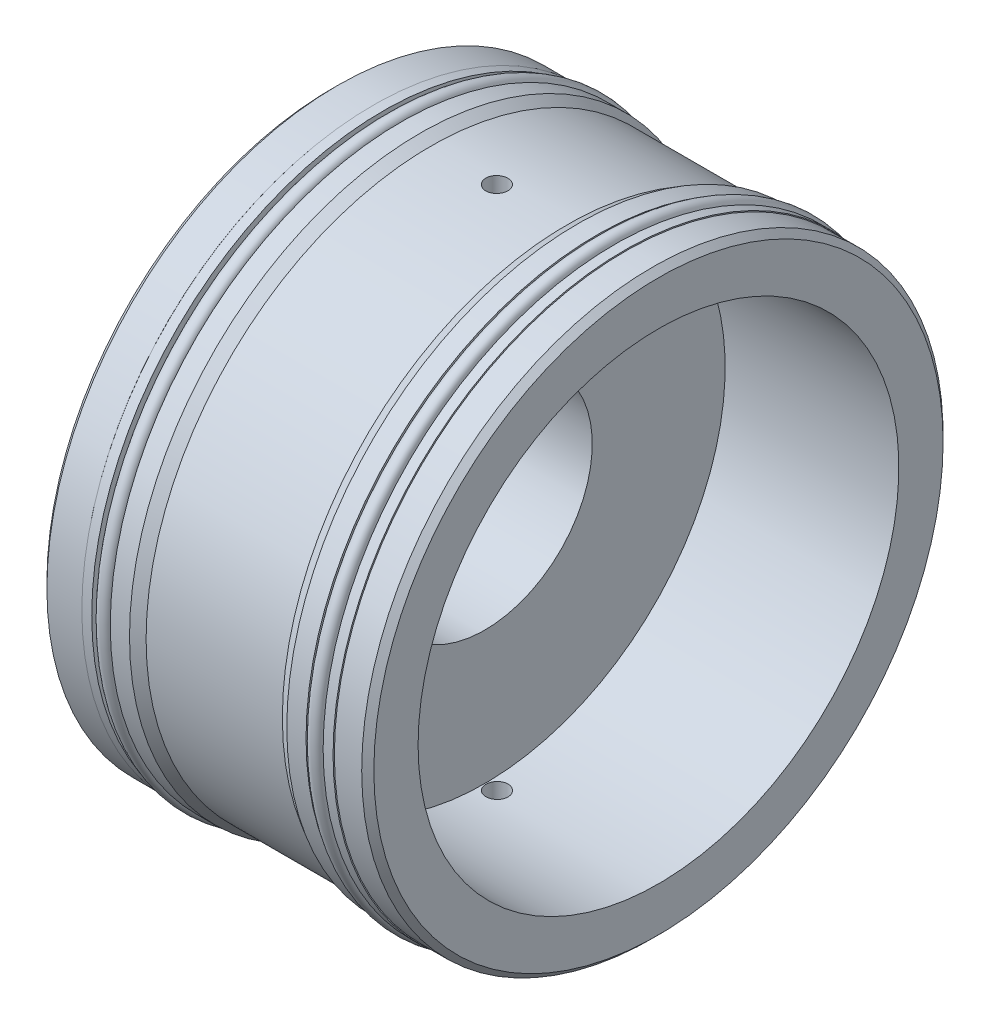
ISO-10303-21;
HEADER;
FILE_DESCRIPTION(('STEP AP214'),'2;1');
FILE_NAME('part.step','',(''),(''),'','','');
FILE_SCHEMA(('AUTOMOTIVE_DESIGN { 1 0 10303 214 1 1 1 1 }'));
ENDSEC;
DATA;
#1=APPLICATION_CONTEXT('core data for automotive mechanical design processes');
#2=APPLICATION_PROTOCOL_DEFINITION('international standard','automotive_design',2000,#1);
#3=PRODUCT_CONTEXT('',#1,'mechanical');
#4=PRODUCT('Part','Part','',(#3));
#5=PRODUCT_RELATED_PRODUCT_CATEGORY('part','',(#4));
#6=PRODUCT_DEFINITION_FORMATION('','',#4);
#7=PRODUCT_DEFINITION_CONTEXT('part definition',#1,'design');
#8=PRODUCT_DEFINITION('design','',#6,#7);
#9=PRODUCT_DEFINITION_SHAPE('','',#8);
#10=(LENGTH_UNIT() NAMED_UNIT(*) SI_UNIT(.MILLI.,.METRE.));
#11=(NAMED_UNIT(*) PLANE_ANGLE_UNIT() SI_UNIT($,.RADIAN.));
#12=(NAMED_UNIT(*) SI_UNIT($,.STERADIAN.) SOLID_ANGLE_UNIT());
#13=UNCERTAINTY_MEASURE_WITH_UNIT(LENGTH_MEASURE(1.E-05),#10,'distance_accuracy_value','');
#14=(GEOMETRIC_REPRESENTATION_CONTEXT(3) GLOBAL_UNCERTAINTY_ASSIGNED_CONTEXT((#13)) GLOBAL_UNIT_ASSIGNED_CONTEXT((#10,
#11,#12)) REPRESENTATION_CONTEXT('',''));
#15=CARTESIAN_POINT('',(0.,0.,0.));
#16=DIRECTION('',(0.,0.,1.));
#17=DIRECTION('',(1.,0.,0.));
#18=AXIS2_PLACEMENT_3D('',#15,#16,#17);
#19=CARTESIAN_POINT('',(0.,0.,0.));
#20=DIRECTION('',(-1.,0.,0.));
#21=DIRECTION('',(0.,0.,1.));
#22=AXIS2_PLACEMENT_3D('',#19,#20,#21);
#23=CYLINDRICAL_SURFACE('',#22,35.7124);
#24=CARTESIAN_POINT('',(-8.0654772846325,0.,0.));
#25=DIRECTION('',(-1.,0.,0.));
#26=DIRECTION('',(0.,0.,1.));
#27=AXIS2_PLACEMENT_3D('',#24,#25,#26);
#28=CIRCLE('',#27,35.7124);
#29=CARTESIAN_POINT('',(-8.0654772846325,0.,35.7124));
#30=VERTEX_POINT('',#29);
#31=EDGE_CURVE('E37',#30,#30,#28,.T.);
#32=ORIENTED_EDGE('',*,*,#31,.F.);
#33=EDGE_LOOP('',(#32));
#34=FACE_BOUND('',#33,.T.);
#35=CARTESIAN_POINT('',(0.2413,-35.6855604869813,1.3843));
#36=CARTESIAN_POINT('',(0.319025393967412,-35.6855608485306,1.38429656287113));
#37=CARTESIAN_POINT('',(0.396806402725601,-35.6858171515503,1.3777318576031));
#38=CARTESIAN_POINT('',(0.550224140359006,-35.686814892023,1.35163624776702));
#39=CARTESIAN_POINT('',(0.625858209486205,-35.687556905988,1.3320899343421));
#40=CARTESIAN_POINT('',(0.77273736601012,-35.6894418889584,1.28059031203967));
#41=CARTESIAN_POINT('',(0.843984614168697,-35.6905846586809,1.24864316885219));
#42=CARTESIAN_POINT('',(0.980085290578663,-35.6931421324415,1.17325783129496));
#43=CARTESIAN_POINT('',(1.04494025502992,-35.6945567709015,1.12982240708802));
#44=CARTESIAN_POINT('',(1.16647824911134,-35.6974996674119,1.0326605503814));
#45=CARTESIAN_POINT('',(1.22315656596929,-35.6990279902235,0.978928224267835));
#46=CARTESIAN_POINT('',(1.32669242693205,-35.7020254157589,0.862708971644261));
#47=CARTESIAN_POINT('',(1.37354957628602,-35.7034945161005,0.800221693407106));
#48=CARTESIAN_POINT('',(1.45612355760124,-35.7062083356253,0.668244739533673));
#49=CARTESIAN_POINT('',(1.49183708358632,-35.7074529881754,0.598752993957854));
#50=CARTESIAN_POINT('',(1.55108871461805,-35.7095770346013,0.45475437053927));
#51=CARTESIAN_POINT('',(1.57462688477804,-35.7104564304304,0.380247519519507));
#52=CARTESIAN_POINT('',(1.60884819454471,-35.7117504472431,0.228373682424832));
#53=CARTESIAN_POINT('',(1.61953784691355,-35.7121653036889,0.151008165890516));
#54=CARTESIAN_POINT('',(1.62777876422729,-35.71248427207,-0.00442023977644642));
#55=CARTESIAN_POINT('',(1.62533010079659,-35.7123883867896,-0.0824831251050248));
#56=CARTESIAN_POINT('',(1.60736934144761,-35.711696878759,-0.237046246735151));
#57=CARTESIAN_POINT('',(1.59186426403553,-35.7111015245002,-0.31354729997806));
#58=CARTESIAN_POINT('',(1.54824167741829,-35.7094784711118,-0.462859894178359));
#59=CARTESIAN_POINT('',(1.52012413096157,-35.7084507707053,-0.535671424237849));
#60=CARTESIAN_POINT('',(1.45206672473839,-35.7060783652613,-0.675560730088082));
#61=CARTESIAN_POINT('',(1.41212365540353,-35.7047335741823,-0.742636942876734));
#62=CARTESIAN_POINT('',(1.3215514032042,-35.701878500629,-0.869134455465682));
#63=CARTESIAN_POINT('',(1.27092217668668,-35.7003682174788,-0.928555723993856));
#64=CARTESIAN_POINT('',(1.16037508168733,-35.6973511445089,-1.03809751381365));
#65=CARTESIAN_POINT('',(1.10045112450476,-35.6958443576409,-1.08821189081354));
#66=CARTESIAN_POINT('',(0.97303702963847,-35.6930051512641,-1.17767002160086));
#67=CARTESIAN_POINT('',(0.905546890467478,-35.6916727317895,-1.2170137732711));
#68=CARTESIAN_POINT('',(0.764912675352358,-35.6893325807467,-1.28381321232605));
#69=CARTESIAN_POINT('',(0.691768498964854,-35.6883248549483,-1.31126868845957));
#70=CARTESIAN_POINT('',(0.541904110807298,-35.686747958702,-1.35350820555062));
#71=CARTESIAN_POINT('',(0.46518391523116,-35.6861787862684,-1.3682923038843));
#72=CARTESIAN_POINT('',(0.310398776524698,-35.6855435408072,-1.38476183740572));
#73=CARTESIAN_POINT('',(0.232334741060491,-35.6854771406,-1.38645579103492));
#74=CARTESIAN_POINT('',(0.0770308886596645,-35.6858540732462,-1.37671916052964));
#75=CARTESIAN_POINT('',(-0.000208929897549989,-35.6862974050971,-1.3652886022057));
#76=CARTESIAN_POINT('',(-0.151647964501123,-35.6876435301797,-1.32963447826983));
#77=CARTESIAN_POINT('',(-0.225848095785,-35.6885461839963,-1.30541479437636));
#78=CARTESIAN_POINT('',(-0.369129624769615,-35.6907090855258,-1.24487385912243));
#79=CARTESIAN_POINT('',(-0.43821100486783,-35.6919693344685,-1.20855256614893));
#80=CARTESIAN_POINT('',(-0.569333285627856,-35.6947061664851,-1.12481751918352));
#81=CARTESIAN_POINT('',(-0.631370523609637,-35.6961828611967,-1.07739803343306));
#82=CARTESIAN_POINT('',(-0.746606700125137,-35.699185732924,-0.972821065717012));
#83=CARTESIAN_POINT('',(-0.799805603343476,-35.7007119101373,-0.915663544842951));
#84=CARTESIAN_POINT('',(-0.895883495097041,-35.7036426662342,-0.793196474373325));
#85=CARTESIAN_POINT('',(-0.938756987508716,-35.7050471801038,-0.727882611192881));
#86=CARTESIAN_POINT('',(-1.01292947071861,-35.7075753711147,-0.590978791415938));
#87=CARTESIAN_POINT('',(-1.04422849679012,-35.7086990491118,-0.519388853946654));
#88=CARTESIAN_POINT('',(-1.09435394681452,-35.710538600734,-0.371985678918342));
#89=CARTESIAN_POINT('',(-1.11318391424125,-35.7112545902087,-0.296173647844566));
#90=CARTESIAN_POINT('',(-1.13784834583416,-35.712198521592,-0.142461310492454));
#91=CARTESIAN_POINT('',(-1.143682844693,-35.7124264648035,-0.064561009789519));
#92=CARTESIAN_POINT('',(-1.14219032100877,-35.7123686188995,0.0910618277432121));
#93=CARTESIAN_POINT('',(-1.13487193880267,-35.7120831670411,0.168784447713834));
#94=CARTESIAN_POINT('',(-1.10729920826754,-35.7110313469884,0.321896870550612));
#95=CARTESIAN_POINT('',(-1.08704483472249,-35.7102649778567,0.39728666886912));
#96=CARTESIAN_POINT('',(-1.03417659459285,-35.7083376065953,0.543595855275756));
#97=CARTESIAN_POINT('',(-1.00156255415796,-35.7071765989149,0.614515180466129));
#98=CARTESIAN_POINT('',(-0.924902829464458,-35.7045906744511,0.749871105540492));
#99=CARTESIAN_POINT('',(-0.8808575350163,-35.7031657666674,0.81430792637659));
#100=CARTESIAN_POINT('',(-0.782556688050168,-35.7002115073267,0.934911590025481));
#101=CARTESIAN_POINT('',(-0.728295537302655,-35.698682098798,0.99107386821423));
#102=CARTESIAN_POINT('',(-0.611098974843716,-35.6956914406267,1.09350809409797));
#103=CARTESIAN_POINT('',(-0.548161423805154,-35.6942302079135,1.13977759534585));
#104=CARTESIAN_POINT('',(-0.415364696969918,-35.6915400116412,1.22112587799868));
#105=CARTESIAN_POINT('',(-0.345500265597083,-35.6903112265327,1.25619607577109));
#106=CARTESIAN_POINT('',(-0.200923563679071,-35.6882275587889,1.31406771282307));
#107=CARTESIAN_POINT('',(-0.126217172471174,-35.6873722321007,1.33688373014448));
#108=CARTESIAN_POINT('',(-0.00231812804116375,-35.686359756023,1.36357609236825));
#109=CARTESIAN_POINT('',(0.0460709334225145,-35.6860613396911,1.37133772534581));
#110=CARTESIAN_POINT('',(0.143399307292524,-35.6856615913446,1.38170076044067));
#111=CARTESIAN_POINT('',(0.192338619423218,-35.6855602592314,1.38430216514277));
#112=CARTESIAN_POINT('',(0.2413,-35.6855604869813,1.3843));
#113=B_SPLINE_CURVE_WITH_KNOTS('',3,(#35,#36,#37,#38,#39,#40,#41,#42,#43,#44,#45,#46,#47,#48,
#49,#50,#51,#52,#53,#54,#55,#56,#57,#58,#59,#60,#61,#62,#63,#64,#65,#66,#67,#68,#69,#70,#71,#72,
#73,#74,#75,#76,#77,#78,#79,#80,#81,#82,#83,#84,#85,#86,#87,#88,#89,#90,#91,#92,#93,#94,#95,#96,
#97,#98,#99,#100,#101,#102,#103,#104,#105,#106,#107,#108,#109,#110,#111,#112),.UNSPECIFIED.,.T.,
.F.,(4,2,2,2,2,2,2,2,2,2,2,2,2,2,2,2,2,2,2,2,2,2,2,2,2,2,2,2,2,2,2,2,2,2,2,2,2,2,4),(0.,
0.232997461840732,0.466271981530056,0.699430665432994,0.932533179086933,1.16576951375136,
1.39901522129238,1.6323300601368,1.86564365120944,2.0988389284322,2.33203293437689,
2.5651016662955,2.79817108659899,3.03130382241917,3.26443751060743,3.4977245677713,
3.73101167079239,3.96430291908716,4.19759311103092,4.4307314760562,4.6638693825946,
4.89693656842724,5.13000455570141,5.363193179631,5.59638273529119,5.8296961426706,
6.06300883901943,6.29625520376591,6.52950094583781,6.76259352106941,6.99568655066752,
7.22878285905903,7.46187121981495,7.69508768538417,7.92836175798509,8.16181419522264,
8.39498828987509,8.54175992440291,8.68853148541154),.UNSPECIFIED.);
#114=CARTESIAN_POINT('',(0.2413,-35.6855604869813,1.3843));
#115=VERTEX_POINT('',#114);
#116=EDGE_CURVE('E48',#115,#115,#113,.T.);
#117=ORIENTED_EDGE('',*,*,#116,.T.);
#118=EDGE_LOOP('',(#117));
#119=FACE_BOUND('',#118,.T.);
#120=CARTESIAN_POINT('',(0.2413,35.6855604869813,1.3843));
#121=CARTESIAN_POINT('',(0.163574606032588,35.6855608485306,1.38429656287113));
#122=CARTESIAN_POINT('',(0.085793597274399,35.6858171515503,1.3777318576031));
#123=CARTESIAN_POINT('',(-0.0676241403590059,35.686814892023,1.35163624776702));
#124=CARTESIAN_POINT('',(-0.143258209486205,35.687556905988,1.3320899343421));
#125=CARTESIAN_POINT('',(-0.29013736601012,35.6894418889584,1.28059031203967));
#126=CARTESIAN_POINT('',(-0.361384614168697,35.6905846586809,1.24864316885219));
#127=CARTESIAN_POINT('',(-0.497485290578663,35.6931421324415,1.17325783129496));
#128=CARTESIAN_POINT('',(-0.562340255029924,35.6945567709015,1.12982240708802));
#129=CARTESIAN_POINT('',(-0.683878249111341,35.6974996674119,1.0326605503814));
#130=CARTESIAN_POINT('',(-0.74055656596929,35.6990279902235,0.978928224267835));
#131=CARTESIAN_POINT('',(-0.844092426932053,35.7020254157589,0.862708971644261));
#132=CARTESIAN_POINT('',(-0.890949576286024,35.7034945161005,0.800221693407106));
#133=CARTESIAN_POINT('',(-0.973523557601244,35.7062083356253,0.668244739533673));
#134=CARTESIAN_POINT('',(-1.00923708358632,35.7074529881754,0.598752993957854));
#135=CARTESIAN_POINT('',(-1.06848871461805,35.7095770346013,0.454754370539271));
#136=CARTESIAN_POINT('',(-1.09202688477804,35.7104564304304,0.380247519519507));
#137=CARTESIAN_POINT('',(-1.12624819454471,35.7117504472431,0.228373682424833));
#138=CARTESIAN_POINT('',(-1.13693784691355,35.7121653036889,0.151008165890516));
#139=CARTESIAN_POINT('',(-1.14517876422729,35.71248427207,-0.00442023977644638));
#140=CARTESIAN_POINT('',(-1.14273010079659,35.7123883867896,-0.0824831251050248));
#141=CARTESIAN_POINT('',(-1.12476934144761,35.711696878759,-0.237046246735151));
#142=CARTESIAN_POINT('',(-1.10926426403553,35.7111015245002,-0.31354729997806));
#143=CARTESIAN_POINT('',(-1.06564167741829,35.7094784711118,-0.462859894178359));
#144=CARTESIAN_POINT('',(-1.03752413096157,35.7084507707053,-0.535671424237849));
#145=CARTESIAN_POINT('',(-0.969466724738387,35.7060783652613,-0.675560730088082));
#146=CARTESIAN_POINT('',(-0.929523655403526,35.7047335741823,-0.742636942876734));
#147=CARTESIAN_POINT('',(-0.838951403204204,35.701878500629,-0.869134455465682));
#148=CARTESIAN_POINT('',(-0.788322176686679,35.7003682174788,-0.928555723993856));
#149=CARTESIAN_POINT('',(-0.677775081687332,35.6973511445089,-1.03809751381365));
#150=CARTESIAN_POINT('',(-0.617851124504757,35.6958443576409,-1.08821189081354));
#151=CARTESIAN_POINT('',(-0.490437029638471,35.6930051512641,-1.17767002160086));
#152=CARTESIAN_POINT('',(-0.422946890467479,35.6916727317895,-1.2170137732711));
#153=CARTESIAN_POINT('',(-0.282312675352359,35.6893325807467,-1.28381321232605));
#154=CARTESIAN_POINT('',(-0.209168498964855,35.6883248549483,-1.31126868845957));
#155=CARTESIAN_POINT('',(-0.0593041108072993,35.686747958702,-1.35350820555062));
#156=CARTESIAN_POINT('',(0.0174160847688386,35.6861787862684,-1.3682923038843));
#157=CARTESIAN_POINT('',(0.172201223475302,35.6855435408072,-1.38476183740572));
#158=CARTESIAN_POINT('',(0.250265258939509,35.6854771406,-1.38645579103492));
#159=CARTESIAN_POINT('',(0.405569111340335,35.6858540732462,-1.37671916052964));
#160=CARTESIAN_POINT('',(0.482808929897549,35.6862974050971,-1.3652886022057));
#161=CARTESIAN_POINT('',(0.634247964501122,35.6876435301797,-1.32963447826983));
#162=CARTESIAN_POINT('',(0.708448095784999,35.6885461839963,-1.30541479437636));
#163=CARTESIAN_POINT('',(0.851729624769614,35.6907090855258,-1.24487385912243));
#164=CARTESIAN_POINT('',(0.920811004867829,35.6919693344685,-1.20855256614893));
#165=CARTESIAN_POINT('',(1.05193328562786,35.6947061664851,-1.12481751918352));
#166=CARTESIAN_POINT('',(1.11397052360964,35.6961828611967,-1.07739803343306));
#167=CARTESIAN_POINT('',(1.22920670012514,35.699185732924,-0.972821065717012));
#168=CARTESIAN_POINT('',(1.28240560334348,35.7007119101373,-0.915663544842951));
#169=CARTESIAN_POINT('',(1.37848349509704,35.7036426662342,-0.793196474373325));
#170=CARTESIAN_POINT('',(1.42135698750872,35.7050471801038,-0.727882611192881));
#171=CARTESIAN_POINT('',(1.49552947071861,35.7075753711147,-0.590978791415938));
#172=CARTESIAN_POINT('',(1.52682849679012,35.7086990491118,-0.519388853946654));
#173=CARTESIAN_POINT('',(1.57695394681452,35.710538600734,-0.371985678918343));
#174=CARTESIAN_POINT('',(1.59578391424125,35.7112545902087,-0.296173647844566));
#175=CARTESIAN_POINT('',(1.62044834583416,35.712198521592,-0.142461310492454));
#176=CARTESIAN_POINT('',(1.626282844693,35.7124264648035,-0.0645610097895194));
#177=CARTESIAN_POINT('',(1.62479032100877,35.7123686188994,0.0910618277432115));
#178=CARTESIAN_POINT('',(1.61747193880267,35.7120831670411,0.168784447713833));
#179=CARTESIAN_POINT('',(1.58989920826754,35.7110313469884,0.321896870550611));
#180=CARTESIAN_POINT('',(1.56964483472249,35.7102649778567,0.397286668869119));
#181=CARTESIAN_POINT('',(1.51677659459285,35.7083376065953,0.543595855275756));
#182=CARTESIAN_POINT('',(1.48416255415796,35.7071765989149,0.614515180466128));
#183=CARTESIAN_POINT('',(1.40750282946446,35.7045906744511,0.749871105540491));
#184=CARTESIAN_POINT('',(1.3634575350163,35.7031657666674,0.814307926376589));
#185=CARTESIAN_POINT('',(1.26515668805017,35.7002115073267,0.934911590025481));
#186=CARTESIAN_POINT('',(1.21089553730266,35.698682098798,0.991073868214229));
#187=CARTESIAN_POINT('',(1.09369897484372,35.6956914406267,1.09350809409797));
#188=CARTESIAN_POINT('',(1.03076142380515,35.6942302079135,1.13977759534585));
#189=CARTESIAN_POINT('',(0.897964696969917,35.6915400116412,1.22112587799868));
#190=CARTESIAN_POINT('',(0.828100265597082,35.6903112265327,1.25619607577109));
#191=CARTESIAN_POINT('',(0.68352356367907,35.6882275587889,1.31406771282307));
#192=CARTESIAN_POINT('',(0.608817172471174,35.6873722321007,1.33688373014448));
#193=CARTESIAN_POINT('',(0.484918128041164,35.686359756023,1.36357609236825));
#194=CARTESIAN_POINT('',(0.436529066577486,35.6860613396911,1.37133772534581));
#195=CARTESIAN_POINT('',(0.339200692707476,35.6856615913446,1.38170076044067));
#196=CARTESIAN_POINT('',(0.290261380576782,35.6855602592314,1.38430216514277));
#197=CARTESIAN_POINT('',(0.2413,35.6855604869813,1.3843));
#198=B_SPLINE_CURVE_WITH_KNOTS('',3,(#120,#121,#122,#123,#124,#125,#126,#127,#128,#129,#130,
#131,#132,#133,#134,#135,#136,#137,#138,#139,#140,#141,#142,#143,#144,#145,#146,#147,#148,#149,
#150,#151,#152,#153,#154,#155,#156,#157,#158,#159,#160,#161,#162,#163,#164,#165,#166,#167,#168,
#169,#170,#171,#172,#173,#174,#175,#176,#177,#178,#179,#180,#181,#182,#183,#184,#185,#186,#187,
#188,#189,#190,#191,#192,#193,#194,#195,#196,#197),.UNSPECIFIED.,.T.,.F.,(4,2,2,2,2,2,2,2,2,2,2,
2,2,2,2,2,2,2,2,2,2,2,2,2,2,2,2,2,2,2,2,2,2,2,2,2,2,2,4),(0.,0.232997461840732,
0.466271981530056,0.699430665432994,0.932533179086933,1.16576951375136,1.39901522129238,
1.6323300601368,1.86564365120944,2.0988389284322,2.33203293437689,2.5651016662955,
2.79817108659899,3.03130382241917,3.26443751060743,3.4977245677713,3.73101167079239,
3.96430291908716,4.19759311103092,4.4307314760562,4.6638693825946,4.89693656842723,
5.13000455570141,5.363193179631,5.59638273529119,5.8296961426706,6.06300883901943,
6.29625520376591,6.52950094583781,6.76259352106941,6.99568655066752,7.22878285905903,
7.46187121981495,7.69508768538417,7.92836175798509,8.16181419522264,8.39498828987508,
8.5417599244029,8.68853148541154),.UNSPECIFIED.);
#199=CARTESIAN_POINT('',(0.2413,35.6855604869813,1.3843));
#200=VERTEX_POINT('',#199);
#201=EDGE_CURVE('E56',#200,#200,#198,.T.);
#202=ORIENTED_EDGE('',*,*,#201,.T.);
#203=EDGE_LOOP('',(#202));
#204=FACE_BOUND('',#203,.T.);
#205=CARTESIAN_POINT('',(9.03067728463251,0.,0.));
#206=DIRECTION('',(1.,0.,0.));
#207=DIRECTION('',(0.,0.,-1.));
#208=AXIS2_PLACEMENT_3D('',#205,#206,#207);
#209=CIRCLE('',#208,35.7124);
#210=CARTESIAN_POINT('',(9.03067728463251,0.,-35.7124));
#211=VERTEX_POINT('',#210);
#212=EDGE_CURVE('E10',#211,#211,#209,.T.);
#213=ORIENTED_EDGE('',*,*,#212,.F.);
#214=EDGE_LOOP('',(#213));
#215=FACE_BOUND('',#214,.T.);
#216=ADVANCED_FACE('F30',(#34,#119,#204,#215),#23,.T.);
#217=CARTESIAN_POINT('',(0.,0.,0.));
#218=DIRECTION('',(-1.,0.,0.));
#219=DIRECTION('',(0.,0.,1.));
#220=AXIS2_PLACEMENT_3D('',#217,#218,#219);
#221=CYLINDRICAL_SURFACE('',#220,35.2171);
#222=CARTESIAN_POINT('',(14.0888071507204,0.,0.));
#223=DIRECTION('',(-1.,0.,0.));
#224=DIRECTION('',(0.,0.,1.));
#225=AXIS2_PLACEMENT_3D('',#222,#223,#224);
#226=CIRCLE('',#225,35.2171);
#227=CARTESIAN_POINT('',(14.0888071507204,0.,35.2171));
#228=VERTEX_POINT('',#227);
#229=EDGE_CURVE('E206',#228,#228,#226,.T.);
#230=ORIENTED_EDGE('',*,*,#229,.F.);
#231=EDGE_LOOP('',(#230));
#232=FACE_BOUND('',#231,.T.);
#233=CARTESIAN_POINT('',(14.9987,0.,0.));
#234=DIRECTION('',(1.,0.,0.));
#235=DIRECTION('',(0.,0.,-1.));
#236=AXIS2_PLACEMENT_3D('',#233,#234,#235);
#237=CIRCLE('',#236,35.2171);
#238=CARTESIAN_POINT('',(14.9987,0.,-35.2171));
#239=VERTEX_POINT('',#238);
#240=EDGE_CURVE('E41',#239,#239,#237,.T.);
#241=ORIENTED_EDGE('',*,*,#240,.F.);
#242=EDGE_LOOP('',(#241));
#243=FACE_BOUND('',#242,.T.);
#244=ADVANCED_FACE('F121',(#232,#243),#221,.T.);
#245=CARTESIAN_POINT('',(16.3195,0.,0.));
#246=DIRECTION('',(-1.,0.,0.));
#247=DIRECTION('',(0.,0.,1.));
#248=AXIS2_PLACEMENT_3D('',#245,#246,#247);
#249=CIRCLE('',#248,35.2171);
#250=CARTESIAN_POINT('',(16.3195,0.,35.2171));
#251=VERTEX_POINT('',#250);
#252=EDGE_CURVE('E167',#251,#251,#249,.T.);
#253=ORIENTED_EDGE('',*,*,#252,.T.);
#254=EDGE_LOOP('',(#253));
#255=FACE_BOUND('',#254,.T.);
#256=CARTESIAN_POINT('',(16.2433,0.,0.));
#257=DIRECTION('',(-1.,0.,0.));
#258=DIRECTION('',(0.,0.,1.));
#259=AXIS2_PLACEMENT_3D('',#256,#257,#258);
#260=CIRCLE('',#259,35.2171);
#261=CARTESIAN_POINT('',(16.2433,0.,35.2171));
#262=VERTEX_POINT('',#261);
#263=EDGE_CURVE('E45',#262,#262,#260,.T.);
#264=ORIENTED_EDGE('',*,*,#263,.F.);
#265=EDGE_LOOP('',(#264));
#266=FACE_BOUND('',#265,.T.);
#267=ADVANCED_FACE('F126',(#255,#266),#221,.T.);
#268=CARTESIAN_POINT('',(12.7635,0.,0.));
#269=DIRECTION('',(-1.,0.,0.));
#270=DIRECTION('',(0.,0.,1.));
#271=AXIS2_PLACEMENT_3D('',#268,#269,#270);
#272=CIRCLE('',#271,35.2171);
#273=CARTESIAN_POINT('',(12.7635,0.,35.2171));
#274=VERTEX_POINT('',#273);
#275=EDGE_CURVE('E158',#274,#274,#272,.T.);
#276=ORIENTED_EDGE('',*,*,#275,.F.);
#277=EDGE_LOOP('',(#276));
#278=FACE_BOUND('',#277,.T.);
#279=CARTESIAN_POINT('',(13.3685928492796,0.,0.));
#280=DIRECTION('',(1.,0.,0.));
#281=DIRECTION('',(0.,0.,-1.));
#282=AXIS2_PLACEMENT_3D('',#279,#280,#281);
#283=CIRCLE('',#282,35.2171);
#284=CARTESIAN_POINT('',(13.3685928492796,0.,-35.2171));
#285=VERTEX_POINT('',#284);
#286=EDGE_CURVE('E209',#285,#285,#283,.T.);
#287=ORIENTED_EDGE('',*,*,#286,.F.);
#288=EDGE_LOOP('',(#287));
#289=FACE_BOUND('',#288,.T.);
#290=ADVANCED_FACE('F129',(#278,#289),#221,.T.);
#291=CARTESIAN_POINT('',(0.,0.,0.));
#292=DIRECTION('',(-1.,0.,0.));
#293=DIRECTION('',(0.,0.,1.));
#294=AXIS2_PLACEMENT_3D('',#291,#292,#293);
#295=CYLINDRICAL_SURFACE('',#294,35.2171);
#296=CARTESIAN_POINT('',(-14.0335,0.,0.));
#297=DIRECTION('',(-1.,0.,0.));
#298=DIRECTION('',(0.,0.,1.));
#299=AXIS2_PLACEMENT_3D('',#296,#297,#298);
#300=CIRCLE('',#299,35.2171);
#301=CARTESIAN_POINT('',(-14.0335,0.,35.2171));
#302=VERTEX_POINT('',#301);
#303=EDGE_CURVE('E194',#302,#302,#300,.T.);
#304=ORIENTED_EDGE('',*,*,#303,.F.);
#305=EDGE_LOOP('',(#304));
#306=FACE_BOUND('',#305,.T.);
#307=CARTESIAN_POINT('',(-13.1236071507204,0.,0.));
#308=DIRECTION('',(1.,0.,0.));
#309=DIRECTION('',(0.,0.,-1.));
#310=AXIS2_PLACEMENT_3D('',#307,#308,#309);
#311=CIRCLE('',#310,35.2171);
#312=CARTESIAN_POINT('',(-13.1236071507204,0.,-35.2171));
#313=VERTEX_POINT('',#312);
#314=EDGE_CURVE('E203',#313,#313,#311,.T.);
#315=ORIENTED_EDGE('',*,*,#314,.F.);
#316=EDGE_LOOP('',(#315));
#317=FACE_BOUND('',#316,.T.);
#318=ADVANCED_FACE('F221',(#306,#317),#295,.T.);
#319=CARTESIAN_POINT('',(-11.7983,0.,0.));
#320=DIRECTION('',(-1.,0.,0.));
#321=DIRECTION('',(0.,0.,1.));
#322=AXIS2_PLACEMENT_3D('',#319,#320,#321);
#323=CIRCLE('',#322,35.2171);
#324=CARTESIAN_POINT('',(-11.7983,0.,35.2171));
#325=VERTEX_POINT('',#324);
#326=EDGE_CURVE('E161',#325,#325,#323,.T.);
#327=ORIENTED_EDGE('',*,*,#326,.T.);
#328=EDGE_LOOP('',(#327));
#329=FACE_BOUND('',#328,.T.);
#330=CARTESIAN_POINT('',(-12.4033928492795,0.,0.));
#331=DIRECTION('',(-1.,0.,0.));
#332=DIRECTION('',(0.,0.,1.));
#333=AXIS2_PLACEMENT_3D('',#330,#331,#332);
#334=CIRCLE('',#333,35.2171);
#335=CARTESIAN_POINT('',(-12.4033928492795,0.,35.2171));
#336=VERTEX_POINT('',#335);
#337=EDGE_CURVE('E200',#336,#336,#334,.T.);
#338=ORIENTED_EDGE('',*,*,#337,.F.);
#339=EDGE_LOOP('',(#338));
#340=FACE_BOUND('',#339,.T.);
#341=ADVANCED_FACE('F269',(#329,#340),#295,.T.);
#342=CARTESIAN_POINT('',(-15.3543,0.,0.));
#343=DIRECTION('',(-1.,0.,0.));
#344=DIRECTION('',(0.,0.,1.));
#345=AXIS2_PLACEMENT_3D('',#342,#343,#344);
#346=CIRCLE('',#345,35.2171);
#347=CARTESIAN_POINT('',(-15.3543,0.,35.2171));
#348=VERTEX_POINT('',#347);
#349=EDGE_CURVE('E258',#348,#348,#346,.T.);
#350=ORIENTED_EDGE('',*,*,#349,.F.);
#351=EDGE_LOOP('',(#350));
#352=FACE_BOUND('',#351,.T.);
#353=CARTESIAN_POINT('',(-15.2781,0.,0.));
#354=DIRECTION('',(1.,0.,0.));
#355=DIRECTION('',(0.,0.,-1.));
#356=AXIS2_PLACEMENT_3D('',#353,#354,#355);
#357=CIRCLE('',#356,35.2171);
#358=CARTESIAN_POINT('',(-15.2781,0.,-35.2171));
#359=VERTEX_POINT('',#358);
#360=EDGE_CURVE('E197',#359,#359,#357,.T.);
#361=ORIENTED_EDGE('',*,*,#360,.F.);
#362=EDGE_LOOP('',(#361));
#363=FACE_BOUND('',#362,.T.);
#364=ADVANCED_FACE('F103',(#352,#363),#295,.T.);
#365=CARTESIAN_POINT('',(0.,0.,0.));
#366=DIRECTION('',(-1.,0.,0.));
#367=DIRECTION('',(0.,0.,1.));
#368=AXIS2_PLACEMENT_3D('',#365,#366,#367);
#369=CYLINDRICAL_SURFACE('',#368,13.4874);
#370=CARTESIAN_POINT('',(-1.2827,0.,0.));
#371=DIRECTION('',(-1.,0.,0.));
#372=DIRECTION('',(0.,0.,1.));
#373=AXIS2_PLACEMENT_3D('',#370,#371,#372);
#374=CIRCLE('',#373,13.4874);
#375=CARTESIAN_POINT('',(-1.2827,0.,13.4874));
#376=VERTEX_POINT('',#375);
#377=EDGE_CURVE('E179',#376,#376,#374,.T.);
#378=ORIENTED_EDGE('',*,*,#377,.F.);
#379=EDGE_LOOP('',(#378));
#380=FACE_BOUND('',#379,.T.);
#381=CARTESIAN_POINT('',(-20.5105,0.,0.));
#382=DIRECTION('',(-1.,0.,0.));
#383=DIRECTION('',(0.,0.,1.));
#384=AXIS2_PLACEMENT_3D('',#381,#382,#383);
#385=CIRCLE('',#384,13.4874);
#386=CARTESIAN_POINT('',(-20.5105,0.,13.4874));
#387=VERTEX_POINT('',#386);
#388=EDGE_CURVE('E252',#387,#387,#385,.T.);
#389=ORIENTED_EDGE('',*,*,#388,.T.);
#390=EDGE_LOOP('',(#389));
#391=FACE_BOUND('',#390,.T.);
#392=ADVANCED_FACE('F100',(#380,#391),#369,.F.);
#393=CARTESIAN_POINT('',(-1.2827,13.4874,0.));
#394=DIRECTION('',(-1.,0.,0.));
#395=DIRECTION('',(0.,0.,1.));
#396=AXIS2_PLACEMENT_3D('',#393,#394,#395);
#397=PLANE('',#396);
#398=CARTESIAN_POINT('',(-1.2827,0.,0.));
#399=DIRECTION('',(-1.,0.,0.));
#400=DIRECTION('',(0.,0.,1.));
#401=AXIS2_PLACEMENT_3D('',#398,#399,#400);
#402=CIRCLE('',#401,30.1625);
#403=CARTESIAN_POINT('',(-1.2827,0.,30.1625));
#404=VERTEX_POINT('',#403);
#405=EDGE_CURVE('E176',#404,#404,#402,.T.);
#406=ORIENTED_EDGE('',*,*,#405,.F.);
#407=EDGE_LOOP('',(#406));
#408=FACE_BOUND('',#407,.T.);
#409=ORIENTED_EDGE('',*,*,#377,.T.);
#410=EDGE_LOOP('',(#409));
#411=FACE_BOUND('',#410,.T.);
#412=ADVANCED_FACE('F94',(#408,#411),#397,.F.);
#413=CARTESIAN_POINT('',(0.,0.,0.));
#414=DIRECTION('',(-1.,0.,0.));
#415=DIRECTION('',(0.,0.,1.));
#416=AXIS2_PLACEMENT_3D('',#413,#414,#415);
#417=CYLINDRICAL_SURFACE('',#416,30.1625);
#418=CARTESIAN_POINT('',(0.2413,-30.1307172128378,1.3843));
#419=CARTESIAN_POINT('',(0.163587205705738,-30.1307176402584,1.38429656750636));
#420=CARTESIAN_POINT('',(0.0858191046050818,-30.1310210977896,1.37773398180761));
#421=CARTESIAN_POINT('',(-0.0675723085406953,-30.1322023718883,1.35164728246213));
#422=CARTESIAN_POINT('',(-0.14319297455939,-30.1330808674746,1.33210784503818));
#423=CARTESIAN_POINT('',(-0.290045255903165,-30.1353124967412,1.28062756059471));
#424=CARTESIAN_POINT('',(-0.361279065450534,-30.136665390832,1.24869297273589));
#425=CARTESIAN_POINT('',(-0.497355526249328,-30.1396930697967,1.17333835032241));
#426=CARTESIAN_POINT('',(-0.562199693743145,-30.1413677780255,1.12992104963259));
#427=CARTESIAN_POINT('',(-0.683732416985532,-30.144852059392,1.03279083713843));
#428=CARTESIAN_POINT('',(-0.740414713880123,-30.1466617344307,0.979070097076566));
#429=CARTESIAN_POINT('',(-0.843961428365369,-30.1502110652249,0.86287332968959));
#430=CARTESIAN_POINT('',(-0.890825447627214,-30.1519507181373,0.800396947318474));
#431=CARTESIAN_POINT('',(-0.973421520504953,-30.1551646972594,0.668430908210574));
#432=CARTESIAN_POINT('',(-1.00914885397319,-30.1566389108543,0.598938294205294));
#433=CARTESIAN_POINT('',(-1.06842704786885,-30.1591548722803,0.454933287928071));
#434=CARTESIAN_POINT('',(-1.09197798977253,-30.1601966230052,0.380420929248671));
#435=CARTESIAN_POINT('',(-1.12621876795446,-30.1617295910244,0.228547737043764));
#436=CARTESIAN_POINT('',(-1.13691774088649,-30.162221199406,0.151188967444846));
#437=CARTESIAN_POINT('',(-1.14517906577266,-30.1625997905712,-0.00422799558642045));
#438=CARTESIAN_POINT('',(-1.14274150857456,-30.1624867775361,-0.0822861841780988));
#439=CARTESIAN_POINT('',(-1.12480656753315,-30.1616691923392,-0.236824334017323));
#440=CARTESIAN_POINT('',(-1.10931902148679,-30.1609650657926,-0.313305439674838));
#441=CARTESIAN_POINT('',(-1.06573898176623,-30.1590450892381,-0.462581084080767));
#442=CARTESIAN_POINT('',(-1.03764644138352,-30.157829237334,-0.535375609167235));
#443=CARTESIAN_POINT('',(-0.969642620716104,-30.1550220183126,-0.675243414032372));
#444=CARTESIAN_POINT('',(-0.929726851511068,-30.1534305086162,-0.742314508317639));
#445=CARTESIAN_POINT('',(-0.839212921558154,-30.1500512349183,-0.868807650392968));
#446=CARTESIAN_POINT('',(-0.788614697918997,-30.1482634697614,-0.928229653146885));
#447=CARTESIAN_POINT('',(-0.678116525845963,-30.1446911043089,-1.03779520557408));
#448=CARTESIAN_POINT('',(-0.618208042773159,-30.1429065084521,-1.08793014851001));
#449=CARTESIAN_POINT('',(-0.490819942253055,-30.1395433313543,-1.17743214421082));
#450=CARTESIAN_POINT('',(-0.42334032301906,-30.137964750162,-1.2167991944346));
#451=CARTESIAN_POINT('',(-0.282720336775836,-30.1351917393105,-1.2836471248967));
#452=CARTESIAN_POINT('',(-0.209579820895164,-30.1339973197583,-1.3111276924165));
#453=CARTESIAN_POINT('',(-0.0597165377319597,-30.132127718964,-1.35341688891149));
#454=CARTESIAN_POINT('',(0.0170062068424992,-30.1314525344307,-1.36822559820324));
#455=CARTESIAN_POINT('',(0.171781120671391,-30.1306981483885,-1.38474008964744));
#456=CARTESIAN_POINT('',(0.24983201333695,-30.130618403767,-1.38645781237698));
#457=CARTESIAN_POINT('',(0.405113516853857,-30.1310624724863,-1.37677272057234));
#458=CARTESIAN_POINT('',(0.482344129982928,-30.1315862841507,-1.36536994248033));
#459=CARTESIAN_POINT('',(0.633759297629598,-30.1331779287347,-1.32977743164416));
#460=CARTESIAN_POINT('',(0.707945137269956,-30.1342455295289,-1.30559315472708));
#461=CARTESIAN_POINT('',(0.851204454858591,-30.1368042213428,-1.24512967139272));
#462=CARTESIAN_POINT('',(0.920277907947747,-30.1382953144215,-1.20885040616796));
#463=CARTESIAN_POINT('',(1.05140666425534,-30.1415342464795,-1.12519610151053));
#464=CARTESIAN_POINT('',(1.11345684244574,-30.1432822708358,-1.07781303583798));
#465=CARTESIAN_POINT('',(1.22872613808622,-30.1468373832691,-0.973307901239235));
#466=CARTESIAN_POINT('',(1.28194520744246,-30.1486444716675,-0.916185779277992));
#467=CARTESIAN_POINT('',(1.37808165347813,-30.1521156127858,-0.793772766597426));
#468=CARTESIAN_POINT('',(1.42099132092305,-30.1537795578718,-0.728475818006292));
#469=CARTESIAN_POINT('',(1.49523822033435,-30.1567753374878,-0.591597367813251));
#470=CARTESIAN_POINT('',(1.52657549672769,-30.1581071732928,-0.520015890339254));
#471=CARTESIAN_POINT('',(1.57677456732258,-30.1602881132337,-0.372629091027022));
#472=CARTESIAN_POINT('',(1.5956413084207,-30.161137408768,-0.296825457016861));
#473=CARTESIAN_POINT('',(1.62037995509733,-30.1622583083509,-0.143122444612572));
#474=CARTESIAN_POINT('',(1.62625191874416,-30.1625299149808,-0.0652230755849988));
#475=CARTESIAN_POINT('',(1.62483375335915,-30.1624648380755,0.0903835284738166));
#476=CARTESIAN_POINT('',(1.61755572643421,-30.1621287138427,0.168090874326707));
#477=CARTESIAN_POINT('',(1.59006916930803,-30.1608871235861,0.321179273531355));
#478=CARTESIAN_POINT('',(1.56986061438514,-30.1599816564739,0.39656032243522));
#479=CARTESIAN_POINT('',(1.51708901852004,-30.1577032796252,0.54285915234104));
#480=CARTESIAN_POINT('',(1.48452584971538,-30.156330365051,0.613776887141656));
#481=CARTESIAN_POINT('',(1.40797169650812,-30.1532715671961,0.749139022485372));
#482=CARTESIAN_POINT('',(1.36398107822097,-30.1515856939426,0.813583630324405));
#483=CARTESIAN_POINT('',(1.26577822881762,-30.1480890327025,0.934230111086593));
#484=CARTESIAN_POINT('',(1.21155772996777,-30.1462781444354,0.990425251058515));
#485=CARTESIAN_POINT('',(1.09443650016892,-30.1427361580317,1.09293248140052));
#486=CARTESIAN_POINT('',(1.03153363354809,-30.1410050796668,1.13924213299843));
#487=CARTESIAN_POINT('',(0.898789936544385,-30.1378169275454,1.22068211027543));
#488=CARTESIAN_POINT('',(0.828943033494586,-30.1363600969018,1.25580253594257));
#489=CARTESIAN_POINT('',(0.684390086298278,-30.1338886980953,1.31377626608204));
#490=CARTESIAN_POINT('',(0.60968991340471,-30.1328736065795,1.33664409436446));
#491=CARTESIAN_POINT('',(0.485653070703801,-30.1316695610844,1.36344992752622));
#492=CARTESIAN_POINT('',(0.437120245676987,-30.1313139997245,1.37125875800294));
#493=CARTESIAN_POINT('',(0.339498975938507,-30.1308376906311,1.38168487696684));
#494=CARTESIAN_POINT('',(0.290410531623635,-30.1307169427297,1.38430216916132));
#495=CARTESIAN_POINT('',(0.2413,-30.1307172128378,1.3843));
#496=B_SPLINE_CURVE_WITH_KNOTS('',3,(#418,#419,#420,#421,#422,#423,#424,#425,#426,#427,#428,
#429,#430,#431,#432,#433,#434,#435,#436,#437,#438,#439,#440,#441,#442,#443,#444,#445,#446,#447,
#448,#449,#450,#451,#452,#453,#454,#455,#456,#457,#458,#459,#460,#461,#462,#463,#464,#465,#466,
#467,#468,#469,#470,#471,#472,#473,#474,#475,#476,#477,#478,#479,#480,#481,#482,#483,#484,#485,
#486,#487,#488,#489,#490,#491,#492,#493,#494,#495),.UNSPECIFIED.,.T.,.F.,(4,2,2,2,2,2,2,2,2,2,2,
2,2,2,2,2,2,2,2,2,2,2,2,2,2,2,2,2,2,2,2,2,2,2,2,2,2,2,4),(0.,0.232959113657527,
0.466193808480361,0.699310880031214,0.932372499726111,1.16561189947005,1.39886075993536,
1.63220834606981,1.86555437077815,2.09873440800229,2.3319128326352,2.56491563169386,
2.79791929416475,3.03101153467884,3.26410514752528,3.49741370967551,3.73072232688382,
3.96403708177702,4.19735035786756,4.43045079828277,4.66355059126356,4.89655096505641,
5.12955247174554,5.36272292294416,5.59589464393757,5.82924018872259,6.06258483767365,
6.29583686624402,6.52908785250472,6.7621242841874,6.99516116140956,7.22820045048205,
7.46123227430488,7.6944532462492,7.92773168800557,8.16121596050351,8.39442285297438,
8.54164126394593,8.68885956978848),.UNSPECIFIED.);
#497=CARTESIAN_POINT('',(0.2413,-30.1307172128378,1.3843));
#498=VERTEX_POINT('',#497);
#499=EDGE_CURVE('E83',#498,#498,#496,.T.);
#500=ORIENTED_EDGE('',*,*,#499,.T.);
#501=EDGE_LOOP('',(#500));
#502=FACE_BOUND('',#501,.T.);
#503=CARTESIAN_POINT('',(0.2413,30.1307172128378,1.3843));
#504=CARTESIAN_POINT('',(0.319012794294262,30.1307176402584,1.38429656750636));
#505=CARTESIAN_POINT('',(0.396780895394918,30.1310210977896,1.37773398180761));
#506=CARTESIAN_POINT('',(0.550172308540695,30.1322023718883,1.35164728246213));
#507=CARTESIAN_POINT('',(0.62579297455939,30.1330808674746,1.33210784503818));
#508=CARTESIAN_POINT('',(0.772645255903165,30.1353124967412,1.28062756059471));
#509=CARTESIAN_POINT('',(0.843879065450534,30.136665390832,1.2486929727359));
#510=CARTESIAN_POINT('',(0.979955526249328,30.1396930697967,1.17333835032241));
#511=CARTESIAN_POINT('',(1.04479969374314,30.1413677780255,1.12992104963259));
#512=CARTESIAN_POINT('',(1.16633241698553,30.144852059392,1.03279083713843));
#513=CARTESIAN_POINT('',(1.22301471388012,30.1466617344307,0.979070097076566));
#514=CARTESIAN_POINT('',(1.32656142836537,30.1502110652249,0.86287332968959));
#515=CARTESIAN_POINT('',(1.37342544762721,30.1519507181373,0.800396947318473));
#516=CARTESIAN_POINT('',(1.45602152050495,30.1551646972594,0.668430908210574));
#517=CARTESIAN_POINT('',(1.49174885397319,30.1566389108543,0.598938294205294));
#518=CARTESIAN_POINT('',(1.55102704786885,30.1591548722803,0.454933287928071));
#519=CARTESIAN_POINT('',(1.57457798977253,30.1601966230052,0.380420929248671));
#520=CARTESIAN_POINT('',(1.60881876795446,30.1617295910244,0.228547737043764));
#521=CARTESIAN_POINT('',(1.61951774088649,30.162221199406,0.151188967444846));
#522=CARTESIAN_POINT('',(1.62777906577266,30.1625997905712,-0.00422799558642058));
#523=CARTESIAN_POINT('',(1.62534150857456,30.1624867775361,-0.082286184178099));
#524=CARTESIAN_POINT('',(1.60740656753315,30.1616691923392,-0.236824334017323));
#525=CARTESIAN_POINT('',(1.59191902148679,30.1609650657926,-0.313305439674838));
#526=CARTESIAN_POINT('',(1.54833898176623,30.1590450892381,-0.462581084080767));
#527=CARTESIAN_POINT('',(1.52024644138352,30.157829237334,-0.535375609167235));
#528=CARTESIAN_POINT('',(1.4522426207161,30.1550220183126,-0.675243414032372));
#529=CARTESIAN_POINT('',(1.41232685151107,30.1534305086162,-0.742314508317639));
#530=CARTESIAN_POINT('',(1.32181292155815,30.1500512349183,-0.868807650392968));
#531=CARTESIAN_POINT('',(1.271214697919,30.1482634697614,-0.928229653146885));
#532=CARTESIAN_POINT('',(1.16071652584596,30.1446911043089,-1.03779520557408));
#533=CARTESIAN_POINT('',(1.10080804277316,30.1429065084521,-1.08793014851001));
#534=CARTESIAN_POINT('',(0.973419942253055,30.1395433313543,-1.17743214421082));
#535=CARTESIAN_POINT('',(0.90594032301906,30.137964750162,-1.2167991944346));
#536=CARTESIAN_POINT('',(0.765320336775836,30.1351917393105,-1.2836471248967));
#537=CARTESIAN_POINT('',(0.692179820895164,30.1339973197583,-1.3111276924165));
#538=CARTESIAN_POINT('',(0.54231653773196,30.132127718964,-1.35341688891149));
#539=CARTESIAN_POINT('',(0.465593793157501,30.1314525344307,-1.36822559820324));
#540=CARTESIAN_POINT('',(0.310818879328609,30.1306981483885,-1.38474008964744));
#541=CARTESIAN_POINT('',(0.23276798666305,30.130618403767,-1.38645781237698));
#542=CARTESIAN_POINT('',(0.0774864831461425,30.1310624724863,-1.37677272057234));
#543=CARTESIAN_POINT('',(0.000255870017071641,30.1315862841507,-1.36536994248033));
#544=CARTESIAN_POINT('',(-0.151159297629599,30.1331779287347,-1.32977743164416));
#545=CARTESIAN_POINT('',(-0.225345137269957,30.1342455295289,-1.30559315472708));
#546=CARTESIAN_POINT('',(-0.368604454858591,30.1368042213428,-1.24512967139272));
#547=CARTESIAN_POINT('',(-0.437677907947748,30.1382953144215,-1.20885040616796));
#548=CARTESIAN_POINT('',(-0.568806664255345,30.1415342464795,-1.12519610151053));
#549=CARTESIAN_POINT('',(-0.630856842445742,30.1432822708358,-1.07781303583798));
#550=CARTESIAN_POINT('',(-0.746126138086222,30.1468373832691,-0.973307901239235));
#551=CARTESIAN_POINT('',(-0.799345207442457,30.1486444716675,-0.916185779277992));
#552=CARTESIAN_POINT('',(-0.89548165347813,30.1521156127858,-0.793772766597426));
#553=CARTESIAN_POINT('',(-0.938391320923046,30.1537795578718,-0.728475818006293));
#554=CARTESIAN_POINT('',(-1.01263822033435,30.1567753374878,-0.591597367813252));
#555=CARTESIAN_POINT('',(-1.04397549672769,30.1581071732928,-0.520015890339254));
#556=CARTESIAN_POINT('',(-1.09417456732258,30.1602881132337,-0.372629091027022));
#557=CARTESIAN_POINT('',(-1.1130413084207,30.161137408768,-0.296825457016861));
#558=CARTESIAN_POINT('',(-1.13777995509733,30.1622583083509,-0.143122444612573));
#559=CARTESIAN_POINT('',(-1.14365191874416,30.1625299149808,-0.065223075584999));
#560=CARTESIAN_POINT('',(-1.14223375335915,30.1624648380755,0.0903835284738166));
#561=CARTESIAN_POINT('',(-1.13495572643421,30.1621287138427,0.168090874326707));
#562=CARTESIAN_POINT('',(-1.10746916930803,30.1608871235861,0.321179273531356));
#563=CARTESIAN_POINT('',(-1.08726061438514,30.1599816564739,0.39656032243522));
#564=CARTESIAN_POINT('',(-1.03448901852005,30.1577032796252,0.54285915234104));
#565=CARTESIAN_POINT('',(-1.00192584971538,30.156330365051,0.613776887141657));
#566=CARTESIAN_POINT('',(-0.925371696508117,30.1532715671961,0.749139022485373));
#567=CARTESIAN_POINT('',(-0.881381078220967,30.1515856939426,0.813583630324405));
#568=CARTESIAN_POINT('',(-0.783178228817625,30.1480890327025,0.934230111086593));
#569=CARTESIAN_POINT('',(-0.72895772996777,30.1462781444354,0.990425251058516));
#570=CARTESIAN_POINT('',(-0.611836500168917,30.1427361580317,1.09293248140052));
#571=CARTESIAN_POINT('',(-0.548933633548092,30.1410050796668,1.13924213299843));
#572=CARTESIAN_POINT('',(-0.416189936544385,30.1378169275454,1.22068211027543));
#573=CARTESIAN_POINT('',(-0.346343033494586,30.1363600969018,1.25580253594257));
#574=CARTESIAN_POINT('',(-0.201790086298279,30.1338886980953,1.31377626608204));
#575=CARTESIAN_POINT('',(-0.12708991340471,30.1328736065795,1.33664409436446));
#576=CARTESIAN_POINT('',(-0.00305307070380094,30.1316695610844,1.36344992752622));
#577=CARTESIAN_POINT('',(0.0454797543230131,30.1313139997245,1.37125875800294));
#578=CARTESIAN_POINT('',(0.143101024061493,30.1308376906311,1.38168487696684));
#579=CARTESIAN_POINT('',(0.192189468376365,30.1307169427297,1.38430216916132));
#580=CARTESIAN_POINT('',(0.2413,30.1307172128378,1.3843));
#581=B_SPLINE_CURVE_WITH_KNOTS('',3,(#503,#504,#505,#506,#507,#508,#509,#510,#511,#512,#513,
#514,#515,#516,#517,#518,#519,#520,#521,#522,#523,#524,#525,#526,#527,#528,#529,#530,#531,#532,
#533,#534,#535,#536,#537,#538,#539,#540,#541,#542,#543,#544,#545,#546,#547,#548,#549,#550,#551,
#552,#553,#554,#555,#556,#557,#558,#559,#560,#561,#562,#563,#564,#565,#566,#567,#568,#569,#570,
#571,#572,#573,#574,#575,#576,#577,#578,#579,#580),.UNSPECIFIED.,.T.,.F.,(4,2,2,2,2,2,2,2,2,2,2,
2,2,2,2,2,2,2,2,2,2,2,2,2,2,2,2,2,2,2,2,2,2,2,2,2,2,2,4),(0.,0.232959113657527,
0.466193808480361,0.699310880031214,0.932372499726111,1.16561189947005,1.39886075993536,
1.63220834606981,1.86555437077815,2.09873440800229,2.3319128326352,2.56491563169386,
2.79791929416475,3.03101153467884,3.26410514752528,3.49741370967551,3.73072232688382,
3.96403708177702,4.19735035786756,4.43045079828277,4.66355059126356,4.89655096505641,
5.12955247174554,5.36272292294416,5.59589464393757,5.82924018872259,6.06258483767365,
6.29583686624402,6.52908785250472,6.7621242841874,6.99516116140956,7.22820045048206,
7.46123227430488,7.6944532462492,7.92773168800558,8.16121596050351,8.39442285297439,
8.54164126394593,8.68885956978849),.UNSPECIFIED.);
#582=CARTESIAN_POINT('',(0.2413,30.1307172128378,1.3843));
#583=VERTEX_POINT('',#582);
#584=EDGE_CURVE('E55',#583,#583,#581,.T.);
#585=ORIENTED_EDGE('',*,*,#584,.T.);
#586=EDGE_LOOP('',(#585));
#587=FACE_BOUND('',#586,.T.);
#588=CARTESIAN_POINT('',(20.5105,0.,0.));
#589=DIRECTION('',(-1.,0.,0.));
#590=DIRECTION('',(0.,0.,1.));
#591=AXIS2_PLACEMENT_3D('',#588,#589,#590);
#592=CIRCLE('',#591,30.1625);
#593=CARTESIAN_POINT('',(20.5105,0.,30.1625));
#594=VERTEX_POINT('',#593);
#595=EDGE_CURVE('E173',#594,#594,#592,.T.);
#596=ORIENTED_EDGE('',*,*,#595,.F.);
#597=EDGE_LOOP('',(#596));
#598=FACE_BOUND('',#597,.T.);
#599=ORIENTED_EDGE('',*,*,#405,.T.);
#600=EDGE_LOOP('',(#599));
#601=FACE_BOUND('',#600,.T.);
#602=ADVANCED_FACE('F88',(#502,#587,#598,#601),#417,.F.);
#603=CARTESIAN_POINT('',(20.5105,36.4744,0.));
#604=DIRECTION('',(-1.,0.,0.));
#605=DIRECTION('',(0.,0.,1.));
#606=AXIS2_PLACEMENT_3D('',#603,#604,#605);
#607=PLANE('',#606);
#608=CARTESIAN_POINT('',(20.5105,0.,0.));
#609=DIRECTION('',(-1.,0.,0.));
#610=DIRECTION('',(0.,0.,1.));
#611=AXIS2_PLACEMENT_3D('',#608,#609,#610);
#612=CIRCLE('',#611,35.7124);
#613=CARTESIAN_POINT('',(20.5105,0.,35.7124));
#614=VERTEX_POINT('',#613);
#615=EDGE_CURVE('E185',#614,#614,#612,.F.);
#616=ORIENTED_EDGE('',*,*,#615,.T.);
#617=EDGE_LOOP('',(#616));
#618=FACE_BOUND('',#617,.T.);
#619=ORIENTED_EDGE('',*,*,#595,.T.);
#620=EDGE_LOOP('',(#619));
#621=FACE_BOUND('',#620,.T.);
#622=ADVANCED_FACE('F93',(#618,#621),#607,.F.);
#623=CARTESIAN_POINT('',(0.,0.,0.));
#624=DIRECTION('',(-1.,0.,0.));
#625=DIRECTION('',(0.,0.,1.));
#626=AXIS2_PLACEMENT_3D('',#623,#624,#625);
#627=CYLINDRICAL_SURFACE('',#626,36.4744);
#628=CARTESIAN_POINT('',(19.7485,0.,0.));
#629=DIRECTION('',(-1.,0.,0.));
#630=DIRECTION('',(0.,0.,1.));
#631=AXIS2_PLACEMENT_3D('',#628,#629,#630);
#632=CIRCLE('',#631,36.4744);
#633=CARTESIAN_POINT('',(19.7485,0.,36.4744));
#634=VERTEX_POINT('',#633);
#635=EDGE_CURVE('E182',#634,#634,#632,.T.);
#636=ORIENTED_EDGE('',*,*,#635,.T.);
#637=EDGE_LOOP('',(#636));
#638=FACE_BOUND('',#637,.T.);
#639=CARTESIAN_POINT('',(16.3195,0.,0.));
#640=DIRECTION('',(-1.,0.,0.));
#641=DIRECTION('',(0.,0.,1.));
#642=AXIS2_PLACEMENT_3D('',#639,#640,#641);
#643=CIRCLE('',#642,36.4744);
#644=CARTESIAN_POINT('',(16.3195,0.,36.4744));
#645=VERTEX_POINT('',#644);
#646=EDGE_CURVE('E170',#645,#645,#643,.T.);
#647=ORIENTED_EDGE('',*,*,#646,.F.);
#648=EDGE_LOOP('',(#647));
#649=FACE_BOUND('',#648,.T.);
#650=ADVANCED_FACE('F228',(#638,#649),#627,.T.);
#651=CARTESIAN_POINT('',(16.3195,36.4744,0.));
#652=DIRECTION('',(1.,0.,0.));
#653=DIRECTION('',(0.,0.,-1.));
#654=AXIS2_PLACEMENT_3D('',#651,#652,#653);
#655=PLANE('',#654);
#656=ORIENTED_EDGE('',*,*,#252,.F.);
#657=EDGE_LOOP('',(#656));
#658=FACE_BOUND('',#657,.T.);
#659=ORIENTED_EDGE('',*,*,#646,.T.);
#660=EDGE_LOOP('',(#659));
#661=FACE_BOUND('',#660,.T.);
#662=ADVANCED_FACE('F226',(#658,#661),#655,.F.);
#663=CARTESIAN_POINT('',(12.7635,35.2171,0.));
#664=DIRECTION('',(-1.,0.,0.));
#665=DIRECTION('',(0.,0.,1.));
#666=AXIS2_PLACEMENT_3D('',#663,#664,#665);
#667=PLANE('',#666);
#668=CARTESIAN_POINT('',(12.7635,0.,0.));
#669=DIRECTION('',(-1.,0.,0.));
#670=DIRECTION('',(0.,0.,1.));
#671=AXIS2_PLACEMENT_3D('',#668,#669,#670);
#672=CIRCLE('',#671,36.4744);
#673=CARTESIAN_POINT('',(12.7635,0.,36.4744));
#674=VERTEX_POINT('',#673);
#675=EDGE_CURVE('E154',#674,#674,#672,.T.);
#676=ORIENTED_EDGE('',*,*,#675,.F.);
#677=EDGE_LOOP('',(#676));
#678=FACE_BOUND('',#677,.T.);
#679=ORIENTED_EDGE('',*,*,#275,.T.);
#680=EDGE_LOOP('',(#679));
#681=FACE_BOUND('',#680,.T.);
#682=ADVANCED_FACE('F225',(#678,#681),#667,.F.);
#683=CARTESIAN_POINT('',(0.,0.,0.));
#684=DIRECTION('',(-1.,0.,0.));
#685=DIRECTION('',(0.,0.,1.));
#686=AXIS2_PLACEMENT_3D('',#683,#684,#685);
#687=CYLINDRICAL_SURFACE('',#686,36.4744);
#688=CARTESIAN_POINT('',(10.3505,0.,0.));
#689=DIRECTION('',(-1.,0.,0.));
#690=DIRECTION('',(0.,0.,1.));
#691=AXIS2_PLACEMENT_3D('',#688,#689,#690);
#692=CIRCLE('',#691,36.4744);
#693=CARTESIAN_POINT('',(10.3505,0.,36.4744));
#694=VERTEX_POINT('',#693);
#695=EDGE_CURVE('E152',#694,#694,#692,.T.);
#696=ORIENTED_EDGE('',*,*,#695,.F.);
#697=EDGE_LOOP('',(#696));
#698=FACE_BOUND('',#697,.T.);
#699=ORIENTED_EDGE('',*,*,#675,.T.);
#700=EDGE_LOOP('',(#699));
#701=FACE_BOUND('',#700,.T.);
#702=ADVANCED_FACE('F280',(#698,#701),#687,.T.);
#703=CARTESIAN_POINT('',(0.,0.,0.));
#704=DIRECTION('',(-1.,0.,0.));
#705=DIRECTION('',(0.,0.,1.));
#706=AXIS2_PLACEMENT_3D('',#703,#704,#705);
#707=CYLINDRICAL_SURFACE('',#706,36.4744);
#708=CARTESIAN_POINT('',(-11.7983,0.,0.));
#709=DIRECTION('',(-1.,0.,0.));
#710=DIRECTION('',(0.,0.,1.));
#711=AXIS2_PLACEMENT_3D('',#708,#709,#710);
#712=CIRCLE('',#711,36.4744);
#713=CARTESIAN_POINT('',(-11.7983,0.,36.4744));
#714=VERTEX_POINT('',#713);
#715=EDGE_CURVE('E155',#714,#714,#712,.T.);
#716=ORIENTED_EDGE('',*,*,#715,.F.);
#717=EDGE_LOOP('',(#716));
#718=FACE_BOUND('',#717,.T.);
#719=CARTESIAN_POINT('',(-9.38529999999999,0.,0.));
#720=DIRECTION('',(-1.,0.,0.));
#721=DIRECTION('',(0.,0.,1.));
#722=AXIS2_PLACEMENT_3D('',#719,#720,#721);
#723=CIRCLE('',#722,36.4744);
#724=CARTESIAN_POINT('',(-9.38529999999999,0.,36.4744));
#725=VERTEX_POINT('',#724);
#726=EDGE_CURVE('E84',#725,#725,#723,.T.);
#727=ORIENTED_EDGE('',*,*,#726,.T.);
#728=EDGE_LOOP('',(#727));
#729=FACE_BOUND('',#728,.T.);
#730=ADVANCED_FACE('F140',(#718,#729),#707,.T.);
#731=CARTESIAN_POINT('',(-11.7983,35.2171,0.));
#732=DIRECTION('',(1.,0.,0.));
#733=DIRECTION('',(0.,0.,-1.));
#734=AXIS2_PLACEMENT_3D('',#731,#732,#733);
#735=PLANE('',#734);
#736=ORIENTED_EDGE('',*,*,#326,.F.);
#737=EDGE_LOOP('',(#736));
#738=FACE_BOUND('',#737,.T.);
#739=ORIENTED_EDGE('',*,*,#715,.T.);
#740=EDGE_LOOP('',(#739));
#741=FACE_BOUND('',#740,.T.);
#742=ADVANCED_FACE('F272',(#738,#741),#735,.F.);
#743=CARTESIAN_POINT('',(-15.3543,36.4744,0.));
#744=DIRECTION('',(-1.,0.,0.));
#745=DIRECTION('',(0.,0.,1.));
#746=AXIS2_PLACEMENT_3D('',#743,#744,#745);
#747=PLANE('',#746);
#748=CARTESIAN_POINT('',(-15.3543,0.,0.));
#749=DIRECTION('',(-1.,0.,0.));
#750=DIRECTION('',(0.,0.,1.));
#751=AXIS2_PLACEMENT_3D('',#748,#749,#750);
#752=CIRCLE('',#751,36.4744);
#753=CARTESIAN_POINT('',(-15.3543,0.,36.4744));
#754=VERTEX_POINT('',#753);
#755=EDGE_CURVE('E254',#754,#754,#752,.T.);
#756=ORIENTED_EDGE('',*,*,#755,.F.);
#757=EDGE_LOOP('',(#756));
#758=FACE_BOUND('',#757,.T.);
#759=ORIENTED_EDGE('',*,*,#349,.T.);
#760=EDGE_LOOP('',(#759));
#761=FACE_BOUND('',#760,.T.);
#762=ADVANCED_FACE('F275',(#758,#761),#747,.F.);
#763=CARTESIAN_POINT('',(0.,0.,0.));
#764=DIRECTION('',(-1.,0.,0.));
#765=DIRECTION('',(0.,0.,1.));
#766=AXIS2_PLACEMENT_3D('',#763,#764,#765);
#767=CYLINDRICAL_SURFACE('',#766,36.4744);
#768=CARTESIAN_POINT('',(-19.7485,0.,0.));
#769=DIRECTION('',(1.,0.,0.));
#770=DIRECTION('',(0.,0.,-1.));
#771=AXIS2_PLACEMENT_3D('',#768,#769,#770);
#772=CIRCLE('',#771,36.4744);
#773=CARTESIAN_POINT('',(-19.7485,0.,-36.4744));
#774=VERTEX_POINT('',#773);
#775=EDGE_CURVE('E191',#774,#774,#772,.T.);
#776=ORIENTED_EDGE('',*,*,#775,.T.);
#777=EDGE_LOOP('',(#776));
#778=FACE_BOUND('',#777,.T.);
#779=ORIENTED_EDGE('',*,*,#755,.T.);
#780=EDGE_LOOP('',(#779));
#781=FACE_BOUND('',#780,.T.);
#782=ADVANCED_FACE('F115',(#778,#781),#767,.T.);
#783=CARTESIAN_POINT('',(-20.5105,13.4874,0.));
#784=DIRECTION('',(1.,0.,0.));
#785=DIRECTION('',(0.,0.,-1.));
#786=AXIS2_PLACEMENT_3D('',#783,#784,#785);
#787=PLANE('',#786);
#788=CARTESIAN_POINT('',(-20.5105,0.,0.));
#789=DIRECTION('',(1.,0.,0.));
#790=DIRECTION('',(0.,0.,-1.));
#791=AXIS2_PLACEMENT_3D('',#788,#789,#790);
#792=CIRCLE('',#791,35.7124);
#793=CARTESIAN_POINT('',(-20.5105,0.,-35.7124));
#794=VERTEX_POINT('',#793);
#795=EDGE_CURVE('E188',#794,#794,#792,.F.);
#796=ORIENTED_EDGE('',*,*,#795,.T.);
#797=EDGE_LOOP('',(#796));
#798=FACE_BOUND('',#797,.T.);
#799=ORIENTED_EDGE('',*,*,#388,.F.);
#800=EDGE_LOOP('',(#799));
#801=FACE_BOUND('',#800,.T.);
#802=ADVANCED_FACE('F107',(#798,#801),#787,.F.);
#803=CARTESIAN_POINT('',(19.7485,0.,0.));
#804=DIRECTION('',(-1.,0.,0.));
#805=DIRECTION('',(0.,0.,1.));
#806=AXIS2_PLACEMENT_3D('',#803,#804,#805);
#807=CONICAL_SURFACE('',#806,36.4744,0.785398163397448);
#808=ORIENTED_EDGE('',*,*,#615,.F.);
#809=EDGE_LOOP('',(#808));
#810=FACE_BOUND('',#809,.T.);
#811=ORIENTED_EDGE('',*,*,#635,.F.);
#812=EDGE_LOOP('',(#811));
#813=FACE_BOUND('',#812,.T.);
#814=ADVANCED_FACE('F105',(#810,#813),#807,.T.);
#815=CARTESIAN_POINT('',(-20.5105,0.,0.));
#816=DIRECTION('',(1.,0.,0.));
#817=DIRECTION('',(0.,0.,-1.));
#818=AXIS2_PLACEMENT_3D('',#815,#816,#817);
#819=CONICAL_SURFACE('',#818,35.7124,0.785398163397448);
#820=ORIENTED_EDGE('',*,*,#775,.F.);
#821=EDGE_LOOP('',(#820));
#822=FACE_BOUND('',#821,.T.);
#823=ORIENTED_EDGE('',*,*,#795,.F.);
#824=EDGE_LOOP('',(#823));
#825=FACE_BOUND('',#824,.T.);
#826=ADVANCED_FACE('F32',(#822,#825),#819,.T.);
#827=CARTESIAN_POINT('',(-15.2781,35.2171,0.));
#828=DIRECTION('',(1.,0.,0.));
#829=DIRECTION('',(0.,0.,-1.));
#830=AXIS2_PLACEMENT_3D('',#827,#828,#829);
#831=PLANE('',#830);
#832=ORIENTED_EDGE('',*,*,#360,.T.);
#833=EDGE_LOOP('',(#832));
#834=FACE_BOUND('',#833,.T.);
#835=CARTESIAN_POINT('',(-15.2781,0.,0.));
#836=DIRECTION('',(-1.,0.,0.));
#837=DIRECTION('',(0.,0.,1.));
#838=AXIS2_PLACEMENT_3D('',#835,#836,#837);
#839=CIRCLE('',#838,36.5633);
#840=CARTESIAN_POINT('',(-15.2781,0.,36.5633));
#841=VERTEX_POINT('',#840);
#842=EDGE_CURVE('E255',#841,#841,#839,.T.);
#843=ORIENTED_EDGE('',*,*,#842,.T.);
#844=EDGE_LOOP('',(#843));
#845=FACE_BOUND('',#844,.T.);
#846=ADVANCED_FACE('F113',(#834,#845),#831,.F.);
#847=CARTESIAN_POINT('',(0.,0.,0.));
#848=DIRECTION('',(-1.,0.,0.));
#849=DIRECTION('',(0.,0.,1.));
#850=AXIS2_PLACEMENT_3D('',#847,#848,#849);
#851=CYLINDRICAL_SURFACE('',#850,36.5633);
#852=ORIENTED_EDGE('',*,*,#842,.F.);
#853=EDGE_LOOP('',(#852));
#854=FACE_BOUND('',#853,.T.);
#855=CARTESIAN_POINT('',(-14.0335,0.,0.));
#856=DIRECTION('',(-1.,0.,0.));
#857=DIRECTION('',(0.,0.,1.));
#858=AXIS2_PLACEMENT_3D('',#855,#856,#857);
#859=CIRCLE('',#858,36.5633);
#860=CARTESIAN_POINT('',(-14.0335,0.,36.5633));
#861=VERTEX_POINT('',#860);
#862=EDGE_CURVE('E261',#861,#861,#859,.T.);
#863=ORIENTED_EDGE('',*,*,#862,.T.);
#864=EDGE_LOOP('',(#863));
#865=FACE_BOUND('',#864,.T.);
#866=ADVANCED_FACE('F296',(#854,#865),#851,.T.);
#867=CARTESIAN_POINT('',(-14.0335,35.2171,0.));
#868=DIRECTION('',(-1.,0.,0.));
#869=DIRECTION('',(0.,0.,1.));
#870=AXIS2_PLACEMENT_3D('',#867,#868,#869);
#871=PLANE('',#870);
#872=ORIENTED_EDGE('',*,*,#862,.F.);
#873=EDGE_LOOP('',(#872));
#874=FACE_BOUND('',#873,.T.);
#875=ORIENTED_EDGE('',*,*,#303,.T.);
#876=EDGE_LOOP('',(#875));
#877=FACE_BOUND('',#876,.T.);
#878=ADVANCED_FACE('F300',(#874,#877),#871,.F.);
#879=CARTESIAN_POINT('',(-12.7635,0.,0.));
#880=DIRECTION('',(-1.,0.,0.));
#881=DIRECTION('',(0.,0.,1.));
#882=AXIS2_PLACEMENT_3D('',#879,#880,#881);
#883=TOROIDAL_SURFACE('',#882,36.0299,0.889000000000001);
#884=ORIENTED_EDGE('',*,*,#337,.T.);
#885=EDGE_LOOP('',(#884));
#886=FACE_BOUND('',#885,.T.);
#887=ORIENTED_EDGE('',*,*,#314,.T.);
#888=EDGE_LOOP('',(#887));
#889=FACE_BOUND('',#888,.T.);
#890=ADVANCED_FACE('F304',(#886,#889),#883,.T.);
#891=CARTESIAN_POINT('',(13.7287,0.,0.));
#892=DIRECTION('',(-1.,0.,0.));
#893=DIRECTION('',(0.,0.,1.));
#894=AXIS2_PLACEMENT_3D('',#891,#892,#893);
#895=TOROIDAL_SURFACE('',#894,36.0299,0.889000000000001);
#896=ORIENTED_EDGE('',*,*,#229,.T.);
#897=EDGE_LOOP('',(#896));
#898=FACE_BOUND('',#897,.T.);
#899=ORIENTED_EDGE('',*,*,#286,.T.);
#900=EDGE_LOOP('',(#899));
#901=FACE_BOUND('',#900,.T.);
#902=ADVANCED_FACE('F308',(#898,#901),#895,.T.);
#903=CARTESIAN_POINT('',(14.9987,35.2171,0.));
#904=DIRECTION('',(1.,0.,0.));
#905=DIRECTION('',(0.,0.,-1.));
#906=AXIS2_PLACEMENT_3D('',#903,#904,#905);
#907=PLANE('',#906);
#908=ORIENTED_EDGE('',*,*,#240,.T.);
#909=EDGE_LOOP('',(#908));
#910=FACE_BOUND('',#909,.T.);
#911=CARTESIAN_POINT('',(14.9987,0.,0.));
#912=DIRECTION('',(-1.,0.,0.));
#913=DIRECTION('',(0.,0.,1.));
#914=AXIS2_PLACEMENT_3D('',#911,#912,#913);
#915=CIRCLE('',#914,36.5633);
#916=CARTESIAN_POINT('',(14.9987,0.,36.5633));
#917=VERTEX_POINT('',#916);
#918=EDGE_CURVE('E326',#917,#917,#915,.T.);
#919=ORIENTED_EDGE('',*,*,#918,.T.);
#920=EDGE_LOOP('',(#919));
#921=FACE_BOUND('',#920,.T.);
#922=ADVANCED_FACE('F312',(#910,#921),#907,.F.);
#923=CARTESIAN_POINT('',(0.,0.,0.));
#924=DIRECTION('',(-1.,0.,0.));
#925=DIRECTION('',(0.,0.,1.));
#926=AXIS2_PLACEMENT_3D('',#923,#924,#925);
#927=CYLINDRICAL_SURFACE('',#926,36.5633);
#928=ORIENTED_EDGE('',*,*,#918,.F.);
#929=EDGE_LOOP('',(#928));
#930=FACE_BOUND('',#929,.T.);
#931=CARTESIAN_POINT('',(16.2433,0.,0.));
#932=DIRECTION('',(-1.,0.,0.));
#933=DIRECTION('',(0.,0.,1.));
#934=AXIS2_PLACEMENT_3D('',#931,#932,#933);
#935=CIRCLE('',#934,36.5633);
#936=CARTESIAN_POINT('',(16.2433,0.,36.5633));
#937=VERTEX_POINT('',#936);
#938=EDGE_CURVE('E329',#937,#937,#935,.T.);
#939=ORIENTED_EDGE('',*,*,#938,.T.);
#940=EDGE_LOOP('',(#939));
#941=FACE_BOUND('',#940,.T.);
#942=ADVANCED_FACE('F315',(#930,#941),#927,.T.);
#943=CARTESIAN_POINT('',(16.2433,35.2171,0.));
#944=DIRECTION('',(-1.,0.,0.));
#945=DIRECTION('',(0.,0.,1.));
#946=AXIS2_PLACEMENT_3D('',#943,#944,#945);
#947=PLANE('',#946);
#948=ORIENTED_EDGE('',*,*,#938,.F.);
#949=EDGE_LOOP('',(#948));
#950=FACE_BOUND('',#949,.T.);
#951=ORIENTED_EDGE('',*,*,#263,.T.);
#952=EDGE_LOOP('',(#951));
#953=FACE_BOUND('',#952,.T.);
#954=ADVANCED_FACE('F71',(#950,#953),#947,.F.);
#955=CARTESIAN_POINT('',(0.2413,-36.9189,0.));
#956=DIRECTION('',(0.,1.,0.));
#957=DIRECTION('',(0.,0.,1.));
#958=AXIS2_PLACEMENT_3D('',#955,#956,#957);
#959=CYLINDRICAL_SURFACE('',#958,1.3843);
#960=ORIENTED_EDGE('',*,*,#201,.F.);
#961=EDGE_LOOP('',(#960));
#962=FACE_BOUND('',#961,.T.);
#963=ORIENTED_EDGE('',*,*,#584,.F.);
#964=EDGE_LOOP('',(#963));
#965=FACE_BOUND('',#964,.T.);
#966=ADVANCED_FACE('F68',(#962,#965),#959,.F.);
#967=ORIENTED_EDGE('',*,*,#116,.F.);
#968=EDGE_LOOP('',(#967));
#969=FACE_BOUND('',#968,.T.);
#970=ORIENTED_EDGE('',*,*,#499,.F.);
#971=EDGE_LOOP('',(#970));
#972=FACE_BOUND('',#971,.T.);
#973=ADVANCED_FACE('F62',(#969,#972),#959,.F.);
#974=CARTESIAN_POINT('',(-8.0654772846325,0.,0.));
#975=DIRECTION('',(-1.,0.,0.));
#976=DIRECTION('',(0.,0.,1.));
#977=AXIS2_PLACEMENT_3D('',#974,#975,#976);
#978=CONICAL_SURFACE('',#977,35.7124,0.523598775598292);
#979=ORIENTED_EDGE('',*,*,#726,.F.);
#980=EDGE_LOOP('',(#979));
#981=FACE_BOUND('',#980,.T.);
#982=ORIENTED_EDGE('',*,*,#31,.T.);
#983=EDGE_LOOP('',(#982));
#984=FACE_BOUND('',#983,.T.);
#985=ADVANCED_FACE('F67',(#981,#984),#978,.T.);
#986=CARTESIAN_POINT('',(10.3505,0.,0.));
#987=DIRECTION('',(1.,0.,0.));
#988=DIRECTION('',(0.,0.,-1.));
#989=AXIS2_PLACEMENT_3D('',#986,#987,#988);
#990=CONICAL_SURFACE('',#989,36.4744,0.523598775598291);
#991=ORIENTED_EDGE('',*,*,#212,.T.);
#992=EDGE_LOOP('',(#991));
#993=FACE_BOUND('',#992,.T.);
#994=ORIENTED_EDGE('',*,*,#695,.T.);
#995=EDGE_LOOP('',(#994));
#996=FACE_BOUND('',#995,.T.);
#997=ADVANCED_FACE('F143',(#993,#996),#990,.T.);
#998=CLOSED_SHELL('',(#216,#244,#267,#290,#318,#341,#364,#392,#412,#602,#622,#650,#662,#682,
#702,#730,#742,#762,#782,#802,#814,#826,#846,#866,#878,#890,#902,#922,#942,#954,#966,#973,#985,#997));
#999=MANIFOLD_SOLID_BREP('B2',#998);
#1000=ADVANCED_BREP_SHAPE_REPRESENTATION('',(#18,#999),#14);
#1001=SHAPE_DEFINITION_REPRESENTATION(#9,#1000);
ENDSEC;
END-ISO-10303-21;
